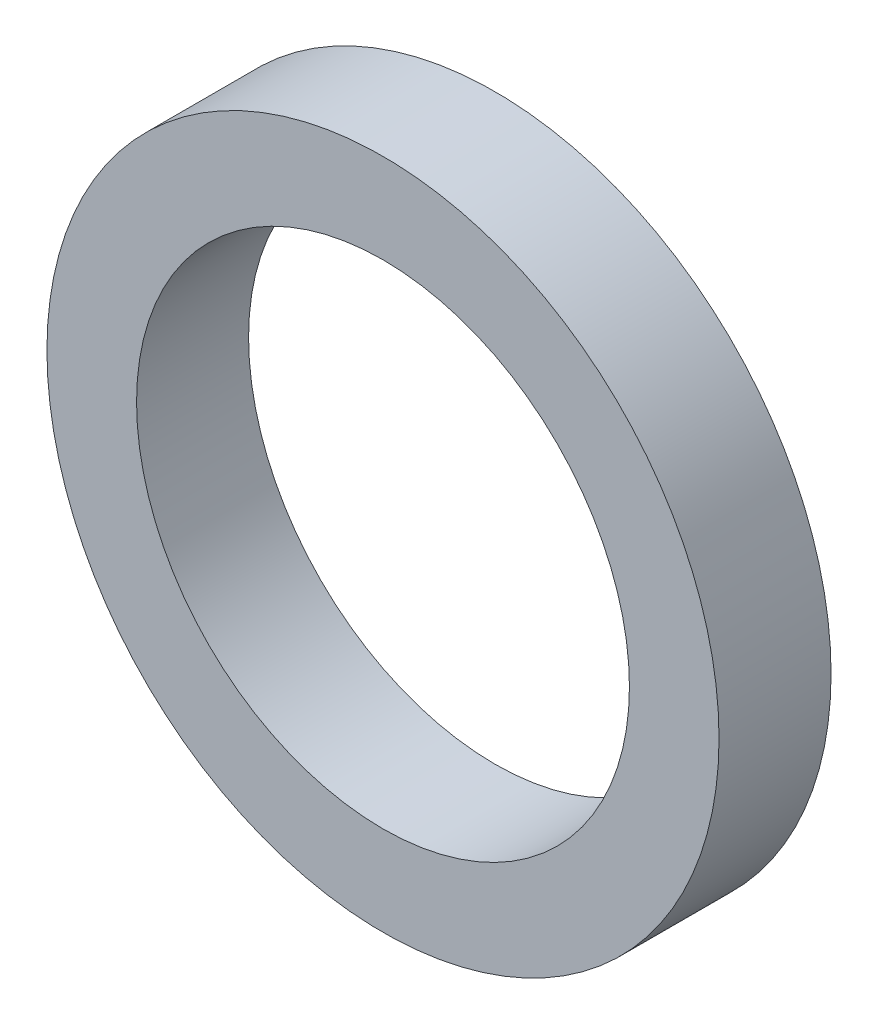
ISO-10303-21;
HEADER;
FILE_DESCRIPTION(('STEP AP214'),'2;1');
FILE_NAME('part.step','',(''),(''),'','','');
FILE_SCHEMA(('AUTOMOTIVE_DESIGN { 1 0 10303 214 1 1 1 1 }'));
ENDSEC;
DATA;
#1=APPLICATION_CONTEXT('core data for automotive mechanical design processes');
#2=APPLICATION_PROTOCOL_DEFINITION('international standard','automotive_design',2000,#1);
#3=PRODUCT_CONTEXT('',#1,'mechanical');
#4=PRODUCT('Part','Part','',(#3));
#5=PRODUCT_RELATED_PRODUCT_CATEGORY('part','',(#4));
#6=PRODUCT_DEFINITION_FORMATION('','',#4);
#7=PRODUCT_DEFINITION_CONTEXT('part definition',#1,'design');
#8=PRODUCT_DEFINITION('design','',#6,#7);
#9=PRODUCT_DEFINITION_SHAPE('','',#8);
#10=(LENGTH_UNIT() NAMED_UNIT(*) SI_UNIT(.MILLI.,.METRE.));
#11=(NAMED_UNIT(*) PLANE_ANGLE_UNIT() SI_UNIT($,.RADIAN.));
#12=(NAMED_UNIT(*) SI_UNIT($,.STERADIAN.) SOLID_ANGLE_UNIT());
#13=UNCERTAINTY_MEASURE_WITH_UNIT(LENGTH_MEASURE(1.E-05),#10,'distance_accuracy_value','');
#14=(GEOMETRIC_REPRESENTATION_CONTEXT(3) GLOBAL_UNCERTAINTY_ASSIGNED_CONTEXT((#13)) GLOBAL_UNIT_ASSIGNED_CONTEXT((#10,
#11,#12)) REPRESENTATION_CONTEXT('',''));
#15=CARTESIAN_POINT('',(0.,0.,0.));
#16=DIRECTION('',(0.,0.,1.));
#17=DIRECTION('',(1.,0.,0.));
#18=AXIS2_PLACEMENT_3D('',#15,#16,#17);
#19=CARTESIAN_POINT('',(0.,0.,25.));
#20=DIRECTION('',(0.,0.,-1.));
#21=DIRECTION('',(-1.,0.,0.));
#22=AXIS2_PLACEMENT_3D('',#19,#20,#21);
#23=CYLINDRICAL_SURFACE('',#22,75.);
#24=CARTESIAN_POINT('',(0.,0.,25.));
#25=DIRECTION('',(0.,0.,1.));
#26=DIRECTION('',(1.,0.,0.));
#27=AXIS2_PLACEMENT_3D('',#24,#25,#26);
#28=CIRCLE('',#27,75.);
#29=CARTESIAN_POINT('',(75.,0.,25.));
#30=VERTEX_POINT('',#29);
#31=EDGE_CURVE('E10',#30,#30,#28,.T.);
#32=ORIENTED_EDGE('',*,*,#31,.F.);
#33=EDGE_LOOP('',(#32));
#34=FACE_BOUND('',#33,.T.);
#35=CARTESIAN_POINT('',(0.,0.,0.));
#36=DIRECTION('',(0.,0.,1.));
#37=DIRECTION('',(1.,0.,0.));
#38=AXIS2_PLACEMENT_3D('',#35,#36,#37);
#39=CIRCLE('',#38,75.);
#40=CARTESIAN_POINT('',(75.,0.,0.));
#41=VERTEX_POINT('',#40);
#42=EDGE_CURVE('E38',#41,#41,#39,.T.);
#43=ORIENTED_EDGE('',*,*,#42,.T.);
#44=EDGE_LOOP('',(#43));
#45=FACE_BOUND('',#44,.T.);
#46=ADVANCED_FACE('F31',(#34,#45),#23,.T.);
#47=CARTESIAN_POINT('',(0.,0.,25.));
#48=DIRECTION('',(0.,0.,1.));
#49=DIRECTION('',(1.,0.,0.));
#50=AXIS2_PLACEMENT_3D('',#47,#48,#49);
#51=PLANE('',#50);
#52=CARTESIAN_POINT('',(0.,0.,25.));
#53=DIRECTION('',(0.,0.,1.));
#54=DIRECTION('',(1.,0.,0.));
#55=AXIS2_PLACEMENT_3D('',#52,#53,#54);
#56=CIRCLE('',#55,55.);
#57=CARTESIAN_POINT('',(55.,0.,25.));
#58=VERTEX_POINT('',#57);
#59=EDGE_CURVE('E44',#58,#58,#56,.T.);
#60=ORIENTED_EDGE('',*,*,#59,.F.);
#61=EDGE_LOOP('',(#60));
#62=FACE_BOUND('',#61,.T.);
#63=ORIENTED_EDGE('',*,*,#31,.T.);
#64=EDGE_LOOP('',(#63));
#65=FACE_BOUND('',#64,.T.);
#66=ADVANCED_FACE('F60',(#62,#65),#51,.T.);
#67=CARTESIAN_POINT('',(0.,0.,0.));
#68=DIRECTION('',(0.,0.,1.));
#69=DIRECTION('',(1.,0.,0.));
#70=AXIS2_PLACEMENT_3D('',#67,#68,#69);
#71=PLANE('',#70);
#72=CARTESIAN_POINT('',(0.,0.,0.));
#73=DIRECTION('',(0.,0.,1.));
#74=DIRECTION('',(1.,0.,0.));
#75=AXIS2_PLACEMENT_3D('',#72,#73,#74);
#76=CIRCLE('',#75,55.);
#77=CARTESIAN_POINT('',(55.,0.,0.));
#78=VERTEX_POINT('',#77);
#79=EDGE_CURVE('E34',#78,#78,#76,.T.);
#80=ORIENTED_EDGE('',*,*,#79,.T.);
#81=EDGE_LOOP('',(#80));
#82=FACE_BOUND('',#81,.T.);
#83=ORIENTED_EDGE('',*,*,#42,.F.);
#84=EDGE_LOOP('',(#83));
#85=FACE_BOUND('',#84,.T.);
#86=ADVANCED_FACE('F51',(#82,#85),#71,.F.);
#87=CARTESIAN_POINT('',(0.,0.,-41.));
#88=DIRECTION('',(0.,0.,1.));
#89=DIRECTION('',(1.,0.,0.));
#90=AXIS2_PLACEMENT_3D('',#87,#88,#89);
#91=CYLINDRICAL_SURFACE('',#90,55.);
#92=ORIENTED_EDGE('',*,*,#59,.T.);
#93=EDGE_LOOP('',(#92));
#94=FACE_BOUND('',#93,.T.);
#95=ORIENTED_EDGE('',*,*,#79,.F.);
#96=EDGE_LOOP('',(#95));
#97=FACE_BOUND('',#96,.T.);
#98=ADVANCED_FACE('F54',(#94,#97),#91,.F.);
#99=CLOSED_SHELL('',(#46,#66,#86,#98));
#100=MANIFOLD_SOLID_BREP('B2',#99);
#101=ADVANCED_BREP_SHAPE_REPRESENTATION('',(#18,#100),#14);
#102=SHAPE_DEFINITION_REPRESENTATION(#9,#101);
ENDSEC;
END-ISO-10303-21;
